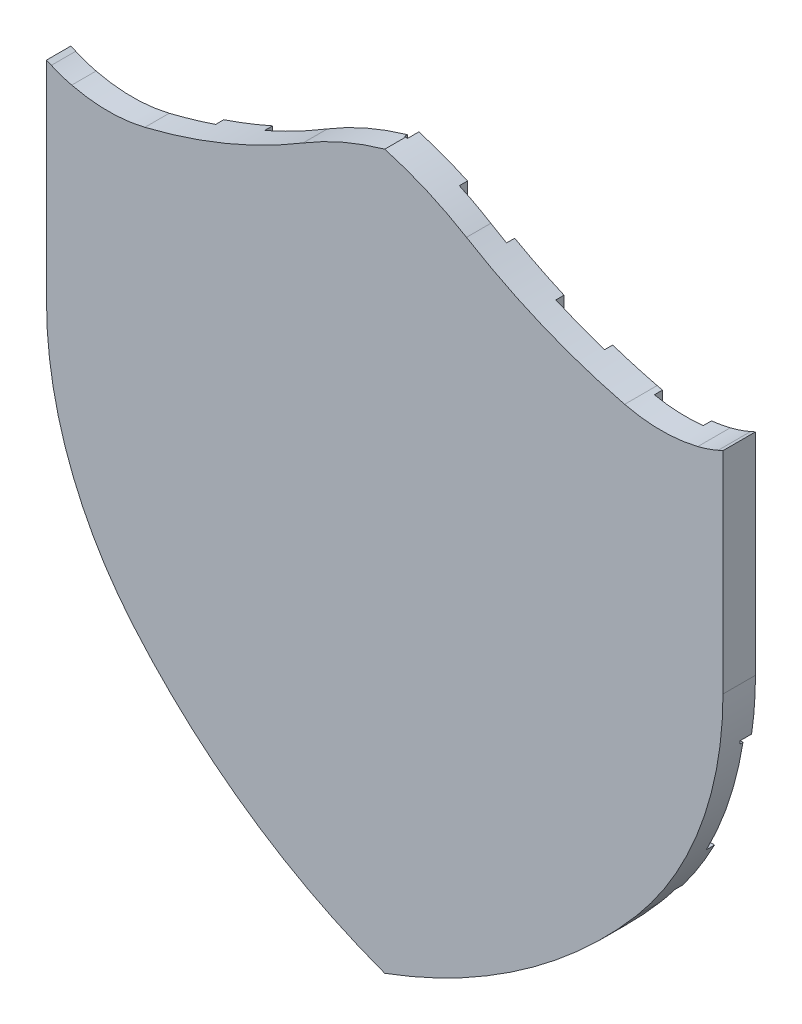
from build123d import *

# Parameters (mm, degrees)
SALIENTE_EXTRUIR1_DEPTH    = 20
SALIENTE_EXTRUIR1_2_DEPTH  = 20
SALIENTE_EXTRUIR1_3_DEPTH  = 20
SALIENTE_EXTRUIR1_4_DEPTH  = 20
SALIENTE_EXTRUIR1_5_DEPTH  = 20
SALIENTE_EXTRUIR1_6_DEPTH  = 20
SALIENTE_EXTRUIR1_7_DEPTH  = 20
SALIENTE_EXTRUIR1_8_DEPTH  = 20
SALIENTE_EXTRUIR1_9_DEPTH  = 20
SALIENTE_EXTRUIR1_10_DEPTH = 20
CROQUIS1_21_W              = 88.067692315
CROQUIS1_21_H              = 71.475035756
CROQUIS1_21_W_2            = 89.408470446
CROQUIS1_21_H_2            = 68.540034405
SALIENTE_EXTRUIR2_DEPTH    = 15
SALIENTE_EXTRUIR3_DEPTH    = 13


with BuildPart() as part:
    # Croquis1 → Saliente-Extruir1 (new body)
    with BuildSketch(Plane.XY):
        with BuildLine():
            Line((263.413544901, 159.69734901), (263.413544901, 228.237383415))
            Line((263.413544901, 228.237383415), (233.454336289, 228.237383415))
            Line((233.454336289, 228.237383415), (233.454336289, 159.69734901))
            Line((233.454336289, 159.69734901), (144.045865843, 159.69734901))
            Line((144.045865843, 159.69734901), (144.045865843, 128.605549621))
            Line((144.045865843, 128.605549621), (233.454336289, 128.605549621))
            Line((233.454336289, 128.605549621), (233.454336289, 58.013431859))
            ThreePointArc((233.454336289, 58.013431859), (248.748362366, 69.757985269), (263.413544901, 82.278935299))
            Line((263.413544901, 82.278935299), (263.413544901, 128.605549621))
            Line((263.413544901, 128.605549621), (306.605446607, 128.605549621))
            ThreePointArc((306.605446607, 128.605549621), (317.020249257, 143.749455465), (326.156478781, 159.69734901))
            Line((326.156478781, 159.69734901), (263.413544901, 159.69734901))
        make_face()
    extrude(amount=-SALIENTE_EXTRUIR1_DEPTH)



with BuildPart() as body_2:
    # Croquis1 → Saliente-Extruir1 2 (new body)
    with BuildSketch(Plane.XY):
        with BuildLine():
            Line((142.045865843, 301.712419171), (142.045865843, 331.800576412))
            Line((142.045865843, 331.800576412), (53.978173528, 331.800576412))
            Line((53.978173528, 331.800576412), (53.978173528, 407.160717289))
            ThreePointArc((53.978173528, 407.160717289), (39.071294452, 400.929225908), (23.892764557, 395.392190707))
            Line((23.892764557, 395.392190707), (23.892764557, 331.800576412))
            Line((23.892764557, 331.800576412), (-65.250885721, 331.800576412))
            Line((-65.250885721, 331.800576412), (-65.250885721, 301.712419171))
            Line((-65.250885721, 301.712419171), (23.892764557, 301.712419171))
            Line((23.892764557, 301.712419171), (23.892764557, 230.237383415))
            Line((23.892764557, 230.237383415), (53.978173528, 230.237383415))
            Line((53.978173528, 230.237383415), (53.978173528, 301.712419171))
            Line((53.978173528, 301.712419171), (142.045865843, 301.712419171))
        make_face()
    extrude(amount=-SALIENTE_EXTRUIR1_2_DEPTH)


with BuildPart() as body_3:
    # Croquis1 → Saliente-Extruir1 3 (new body)
    with BuildSketch(Plane.XY):
        with BuildLine():
            ThreePointArc((113.403967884, 22.083862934), (127.599498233, 15.77646567), (142.045865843, 10.066929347))
            Line((142.045865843, 10.066929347), (142.045865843, 228.237383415))
            Line((142.045865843, 228.237383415), (113.403967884, 228.237383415))
            Line((113.403967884, 228.237383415), (113.403967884, 22.083862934))
        make_face()
    extrude(amount=-SALIENTE_EXTRUIR1_3_DEPTH)


with BuildPart() as body_4:
    # Croquis1 → Saliente-Extruir1 4 (new body)
    with BuildSketch(Plane.XY):
        with BuildLine():
            ThreePointArc((53.978173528, 57.042535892), (68.55791187, 47.05160724), (83.595547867, 37.764146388))
            Line((83.595547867, 37.764146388), (83.595547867, 228.237383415))
            Line((83.595547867, 228.237383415), (53.978173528, 228.237383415))
            Line((53.978173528, 228.237383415), (53.978173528, 57.042535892))
        make_face()
    extrude(amount=-SALIENTE_EXTRUIR1_4_DEPTH)


with BuildPart() as body_5:
    # Croquis1 → Saliente-Extruir1 5 (new body)
    with BuildSketch(Plane.XY):
        with BuildLine():
            ThreePointArc((-4.692916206, 109.605456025), (9.214989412, 95.011020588), (23.892764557, 81.191096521))
            Line((23.892764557, 81.191096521), (23.892764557, 228.237383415))
            Line((23.892764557, 228.237383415), (-4.692916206, 228.237383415))
            Line((-4.692916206, 228.237383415), (-4.692916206, 109.605456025))
        make_face()
    extrude(amount=-SALIENTE_EXTRUIR1_5_DEPTH)


with BuildPart() as body_6:
    # Croquis1 → Saliente-Extruir1 6 (new body)
    with BuildSketch(Plane.XY):
        with BuildLine():
            Line((-36.086224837, 152.375936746), (-36.086224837, 228.237383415))
            Line((-36.086224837, 228.237383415), (-62.562861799, 228.237383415))
            ThreePointArc((-62.562861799, 228.237383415), (-52.759072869, 189.107964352), (-36.086224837, 152.375936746))
        make_face()
    extrude(amount=-SALIENTE_EXTRUIR1_6_DEPTH)


with BuildPart() as body_7:
    # Croquis1 → Saliente-Extruir1 7 (new body)
    with BuildSketch(Plane.XY):
        with BuildLine():
            Line((324.245660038, 230.237383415), (348.958236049, 230.237383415))
            ThreePointArc((348.958236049, 230.237383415), (350.745725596, 246.47955358), (351.342617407, 262.808880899))
            Line((351.342617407, 262.808880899), (351.342617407, 392.630681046))
            Line((351.342617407, 392.630681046), (348.369624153, 391.318656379))
            ThreePointArc((348.369624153, 391.318656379), (342.193138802, 388.908015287), (335.830563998, 387.043128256))
            ThreePointArc((335.830563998, 387.043128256), (330.070923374, 385.813509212), (324.245660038, 384.94648546))
            Line((324.245660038, 384.94648546), (324.245660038, 230.237383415))
        make_face()
    extrude(amount=-SALIENTE_EXTRUIR1_7_DEPTH)


with BuildPart() as body_8:
    # Croquis1 → Saliente-Extruir1 8 (new body)
    with BuildSketch(Plane.XY):
        with BuildLine():
            Line((263.413544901, 230.237383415), (294.093896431, 230.237383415))
            Line((294.093896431, 230.237383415), (294.093896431, 386.290623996))
            ThreePointArc((294.093896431, 386.290623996), (292.435880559, 386.651961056), (290.784647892, 387.043128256))
            ThreePointArc((290.784647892, 387.043128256), (277.018263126, 390.734460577), (263.413544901, 394.983098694))
            Line((263.413544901, 394.983098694), (263.413544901, 230.237383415))
        make_face()
    extrude(amount=-SALIENTE_EXTRUIR1_8_DEPTH)


with BuildPart() as body_9:
    # Croquis1 → Saliente-Extruir1 9 (new body)
    with BuildSketch(Plane.XY):
        with BuildLine():
            Line((203.055497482, 230.237383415), (233.454336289, 230.237383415))
            Line((233.454336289, 230.237383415), (233.454336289, 406.566885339))
            ThreePointArc((233.454336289, 406.566885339), (218.070491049, 413.792736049), (203.055497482, 421.756753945))
            Line((203.055497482, 421.756753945), (203.055497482, 230.237383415))
        make_face()
    extrude(amount=-SALIENTE_EXTRUIR1_9_DEPTH)


with BuildPart() as body_10:
    # Croquis1 → Saliente-Extruir1 10 (new body)
    with BuildSketch(Plane.XY):
        with BuildLine():
            Line((144.045865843, 230.237383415), (173.997086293, 230.237383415))
            Line((173.997086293, 230.237383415), (173.997086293, 437.747373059))
            ThreePointArc((173.997086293, 437.747373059), (159.240729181, 443.947651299), (144.045865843, 448.978521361))
            Line((144.045865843, 448.978521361), (144.045865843, 230.237383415))
        make_face()
    extrude(amount=-SALIENTE_EXTRUIR1_10_DEPTH)


with BuildPart() as part_1:
    add(part.part)

    add(body_2.part)  # Saliente-Extruir2 merges body 2

    add(body_3.part)  # Saliente-Extruir2 merges body 3

    add(body_4.part)  # Saliente-Extruir2 merges body 4

    add(body_5.part)  # Saliente-Extruir2 merges body 5

    add(body_6.part)  # Saliente-Extruir2 merges body 6

    add(body_7.part)  # Saliente-Extruir2 merges body 7

    add(body_8.part)  # Saliente-Extruir2 merges body 8

    add(body_9.part)  # Saliente-Extruir2 merges body 9

    add(body_10.part)  # Saliente-Extruir2 merges body 10
    # Croquis1_21 → Saliente-Extruir2 (add)
    with BuildSketch(Plane.XY):
        with Locations((98.012019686, 265.974901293)):
            Rectangle(CROQUIS1_21_W, CROQUIS1_21_H)
        with BuildLine():
            Line((-62.866504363, 230.237383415), (23.892764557, 230.237383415))
            Line((23.892764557, 230.237383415), (23.892764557, 301.712419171))
            Line((23.892764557, 301.712419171), (-65.250885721, 301.712419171))
            Line((-65.250885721, 301.712419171), (-65.250885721, 262.808880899))
            ThreePointArc((-65.250885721, 262.808880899), (-64.65399391, 246.47955358), (-62.866504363, 230.237383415))
        make_face()
        with BuildLine():
            Line((142.045865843, 331.800576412), (142.045865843, 448.978521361))
            ThreePointArc((142.045865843, 448.978521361), (116.668707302, 439.815127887), (92.713707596, 427.400380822))
            ThreePointArc((92.713707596, 427.400380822), (73.662101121, 416.67546745), (53.978173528, 407.160717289))
            Line((53.978173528, 407.160717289), (53.978173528, 331.800576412))
            Line((53.978173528, 331.800576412), (142.045865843, 331.800576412))
        make_face()
        with BuildLine():
            Line((23.892764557, 331.800576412), (23.892764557, 395.392190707))
            ThreePointArc((23.892764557, 395.392190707), (9.688744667, 390.913554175), (-4.692916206, 387.043128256))
            ThreePointArc((-4.692916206, 387.043128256), (-27.215874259, 384.308813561), (-49.738832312, 387.043128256))
            ThreePointArc((-49.738832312, 387.043128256), (-56.101407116, 388.908015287), (-62.277892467, 391.318656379))
            Line((-62.277892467, 391.318656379), (-65.250885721, 392.630681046))
            Line((-65.250885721, 392.630681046), (-65.250885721, 331.800576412))
            Line((-65.250885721, 331.800576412), (23.892764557, 331.800576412))
        make_face()
        with BuildLine():
            Line((173.997086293, 230.237383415), (203.055497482, 230.237383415))
            Line((203.055497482, 230.237383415), (203.055497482, 421.756753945))
            ThreePointArc((203.055497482, 421.756753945), (198.194183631, 424.53985295), (193.37802409, 427.400380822))
            ThreePointArc((193.37802409, 427.400380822), (183.826177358, 432.833529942), (173.997086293, 437.747373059))
            Line((173.997086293, 437.747373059), (173.997086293, 230.237383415))
        make_face()
        with BuildLine():
            Line((233.454336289, 230.237383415), (263.413544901, 230.237383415))
            Line((263.413544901, 230.237383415), (263.413544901, 394.983098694))
            ThreePointArc((263.413544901, 394.983098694), (248.301012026, 400.431198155), (233.454336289, 406.566885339))
            Line((233.454336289, 406.566885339), (233.454336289, 230.237383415))
        make_face()
        with BuildLine():
            Line((294.093896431, 230.237383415), (324.245660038, 230.237383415))
            Line((324.245660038, 230.237383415), (324.245660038, 384.94648546))
            ThreePointArc((324.245660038, 384.94648546), (309.115554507, 384.402206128), (294.093896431, 386.290623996))
            Line((294.093896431, 386.290623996), (294.093896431, 230.237383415))
        make_face()
        with BuildLine():
            ThreePointArc((326.156478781, 159.69734901), (340.187039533, 193.054343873), (348.654593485, 228.237383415))
            Line((348.654593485, 228.237383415), (263.413544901, 228.237383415))
            Line((263.413544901, 228.237383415), (263.413544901, 159.69734901))
            Line((263.413544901, 159.69734901), (326.156478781, 159.69734901))
        make_face()
        with Locations((188.750101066, 193.967366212)):
            Rectangle(CROQUIS1_21_W_2, CROQUIS1_21_H_2)
        with BuildLine():
            Line((233.454336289, 128.605549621), (144.045865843, 128.605549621))
            Line((144.045865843, 128.605549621), (144.045865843, 10.066929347))
            ThreePointArc((144.045865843, 10.066929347), (190.391530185, 30.979317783), (233.454336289, 58.013431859))
            Line((233.454336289, 58.013431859), (233.454336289, 128.605549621))
        make_face()
        with BuildLine():
            ThreePointArc((298.130357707, 117.993470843), (302.44846805, 123.235168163), (306.605446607, 128.605549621))
            Line((306.605446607, 128.605549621), (263.413544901, 128.605549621))
            Line((263.413544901, 128.605549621), (263.413544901, 82.278935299))
            ThreePointArc((263.413544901, 82.278935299), (281.370080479, 99.554783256), (298.130357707, 117.993470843))
        make_face()
        with BuildLine():
            ThreePointArc((83.595547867, 37.764146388), (98.322285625, 29.586627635), (113.403967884, 22.083862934))
            Line((113.403967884, 22.083862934), (113.403967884, 228.237383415))
            Line((113.403967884, 228.237383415), (83.595547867, 228.237383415))
            Line((83.595547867, 228.237383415), (83.595547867, 37.764146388))
        make_face()
        with BuildLine():
            ThreePointArc((23.892764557, 81.191096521), (38.622360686, 68.726731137), (53.978173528, 57.042535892))
            Line((53.978173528, 57.042535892), (53.978173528, 228.237383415))
            Line((53.978173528, 228.237383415), (23.892764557, 228.237383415))
            Line((23.892764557, 228.237383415), (23.892764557, 81.191096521))
        make_face()
        with BuildLine():
            ThreePointArc((-12.038626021, 117.993470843), (-8.397184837, 113.771953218), (-4.692916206, 109.605456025))
            Line((-4.692916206, 109.605456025), (-4.692916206, 228.237383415))
            Line((-4.692916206, 228.237383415), (-36.086224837, 228.237383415))
            Line((-36.086224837, 228.237383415), (-36.086224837, 152.375936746))
            ThreePointArc((-36.086224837, 152.375936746), (-24.870451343, 134.619558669), (-12.038626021, 117.993470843))
        make_face()
    extrude(amount=-SALIENTE_EXTRUIR2_DEPTH)

    # Croquis1_22 → Saliente-Extruir3 (add)
    with BuildSketch(Plane.XY):
        with BuildLine():
            ThreePointArc((348.654593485, 228.237383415), (348.808675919, 229.237040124), (348.958236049, 230.237383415))
            Line((348.958236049, 230.237383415), (324.245660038, 230.237383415))
            Line((324.245660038, 230.237383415), (294.093896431, 230.237383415))
            Line((294.093896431, 230.237383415), (263.413544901, 230.237383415))
            Line((263.413544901, 230.237383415), (233.454336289, 230.237383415))
            Line((233.454336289, 230.237383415), (203.055497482, 230.237383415))
            Line((203.055497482, 230.237383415), (173.997086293, 230.237383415))
            Line((173.997086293, 230.237383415), (144.045865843, 230.237383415))
            Line((144.045865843, 230.237383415), (144.045865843, 448.978521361))
            ThreePointArc((144.045865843, 448.978521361), (143.54604682, 449.121942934), (143.045865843, 449.264097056))
            ThreePointArc((143.045865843, 449.264097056), (142.545684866, 449.121942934), (142.045865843, 448.978521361))
            Line((142.045865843, 448.978521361), (142.045865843, 331.800576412))
            Line((142.045865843, 331.800576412), (142.045865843, 301.712419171))
            Line((142.045865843, 301.712419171), (142.045865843, 230.237383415))
            Line((142.045865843, 230.237383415), (53.978173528, 230.237383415))
            Line((53.978173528, 230.237383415), (23.892764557, 230.237383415))
            Line((23.892764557, 230.237383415), (-62.866504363, 230.237383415))
            ThreePointArc((-62.866504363, 230.237383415), (-62.716944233, 229.237040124), (-62.562861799, 228.237383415))
            Line((-62.562861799, 228.237383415), (-36.086224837, 228.237383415))
            Line((-36.086224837, 228.237383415), (-4.692916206, 228.237383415))
            Line((-4.692916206, 228.237383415), (23.892764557, 228.237383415))
            Line((23.892764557, 228.237383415), (53.978173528, 228.237383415))
            Line((53.978173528, 228.237383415), (83.595547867, 228.237383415))
            Line((83.595547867, 228.237383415), (113.403967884, 228.237383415))
            Line((113.403967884, 228.237383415), (142.045865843, 228.237383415))
            Line((142.045865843, 228.237383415), (142.045865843, 10.066929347))
            ThreePointArc((142.045865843, 10.066929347), (142.545733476, 9.88174257), (143.045865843, 9.697271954))
            ThreePointArc((143.045865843, 9.697271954), (143.54599821, 9.88174257), (144.045865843, 10.066929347))
            Line((144.045865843, 10.066929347), (144.045865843, 128.605549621))
            Line((144.045865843, 128.605549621), (144.045865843, 159.69734901))
            Line((144.045865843, 159.69734901), (144.045865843, 228.237383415))
            Line((144.045865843, 228.237383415), (233.454336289, 228.237383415))
            Line((233.454336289, 228.237383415), (263.413544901, 228.237383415))
            Line((263.413544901, 228.237383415), (348.654593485, 228.237383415))
        make_face()
    extrude(amount=-SALIENTE_EXTRUIR3_DEPTH)


solid = part_1.part
